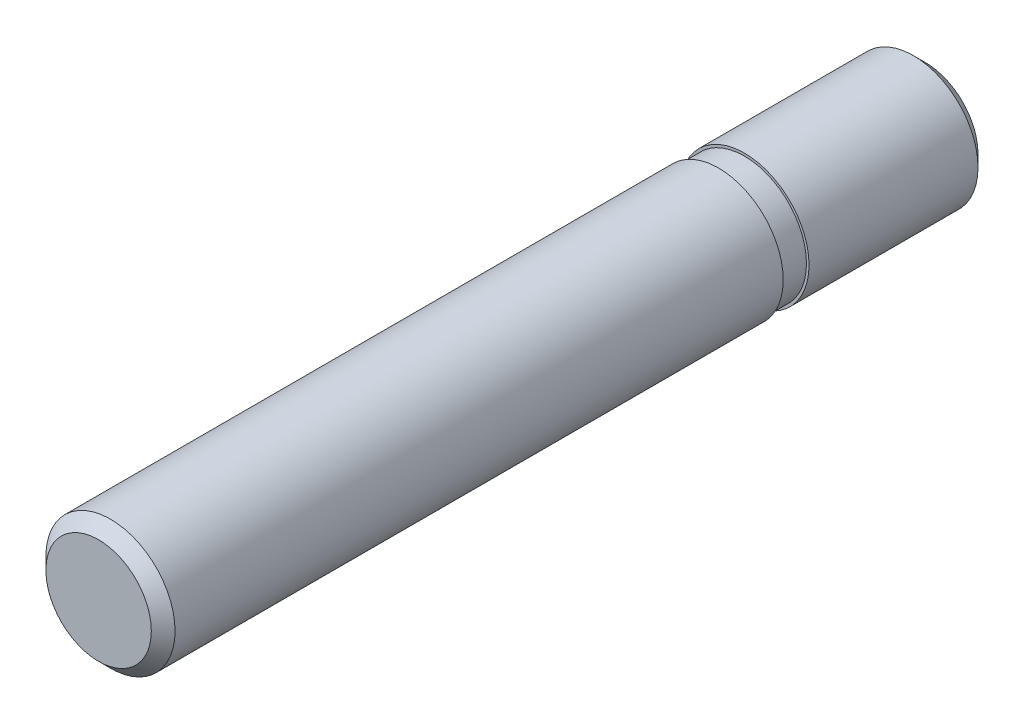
ISO-10303-21;
HEADER;
FILE_DESCRIPTION(('STEP AP214'),'2;1');
FILE_NAME('part.step','',(''),(''),'','','');
FILE_SCHEMA(('AUTOMOTIVE_DESIGN { 1 0 10303 214 1 1 1 1 }'));
ENDSEC;
DATA;
#1=APPLICATION_CONTEXT('core data for automotive mechanical design processes');
#2=APPLICATION_PROTOCOL_DEFINITION('international standard','automotive_design',2000,#1);
#3=PRODUCT_CONTEXT('',#1,'mechanical');
#4=PRODUCT('Part','Part','',(#3));
#5=PRODUCT_RELATED_PRODUCT_CATEGORY('part','',(#4));
#6=PRODUCT_DEFINITION_FORMATION('','',#4);
#7=PRODUCT_DEFINITION_CONTEXT('part definition',#1,'design');
#8=PRODUCT_DEFINITION('design','',#6,#7);
#9=PRODUCT_DEFINITION_SHAPE('','',#8);
#10=(LENGTH_UNIT() NAMED_UNIT(*) SI_UNIT(.MILLI.,.METRE.));
#11=(NAMED_UNIT(*) PLANE_ANGLE_UNIT() SI_UNIT($,.RADIAN.));
#12=(NAMED_UNIT(*) SI_UNIT($,.STERADIAN.) SOLID_ANGLE_UNIT());
#13=UNCERTAINTY_MEASURE_WITH_UNIT(LENGTH_MEASURE(1.E-05),#10,'distance_accuracy_value','');
#14=(GEOMETRIC_REPRESENTATION_CONTEXT(3) GLOBAL_UNCERTAINTY_ASSIGNED_CONTEXT((#13)) GLOBAL_UNIT_ASSIGNED_CONTEXT((#10,
#11,#12)) REPRESENTATION_CONTEXT('',''));
#15=CARTESIAN_POINT('',(0.,0.,0.));
#16=DIRECTION('',(0.,0.,1.));
#17=DIRECTION('',(1.,0.,0.));
#18=AXIS2_PLACEMENT_3D('',#15,#16,#17);
#19=CARTESIAN_POINT('',(0.,2.04,-14.));
#20=DIRECTION('',(0.,0.,-1.));
#21=DIRECTION('',(-1.,0.,0.));
#22=AXIS2_PLACEMENT_3D('',#19,#20,#21);
#23=PLANE('',#22);
#24=CARTESIAN_POINT('',(0.,0.,-14.));
#25=DIRECTION('',(0.,0.,1.));
#26=DIRECTION('',(1.,0.,0.));
#27=AXIS2_PLACEMENT_3D('',#24,#25,#26);
#28=CIRCLE('',#27,4.08000000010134);
#29=CARTESIAN_POINT('',(4.08000000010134,0.,-14.));
#30=VERTEX_POINT('',#29);
#31=EDGE_CURVE('E19',#30,#30,#28,.T.);
#32=ORIENTED_EDGE('',*,*,#31,.F.);
#33=EDGE_LOOP('',(#32));
#34=FACE_BOUND('',#33,.T.);
#35=ADVANCED_FACE('F12',(#34),#23,.T.);
#36=CARTESIAN_POINT('',(0.,0.,-13.080000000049));
#37=DIRECTION('',(0.,0.,1.));
#38=DIRECTION('',(1.,0.,0.));
#39=AXIS2_PLACEMENT_3D('',#36,#37,#38);
#40=CONICAL_SURFACE('',#39,5.0000000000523,0.785398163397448);
#41=CARTESIAN_POINT('',(0.,0.,-13.08));
#42=DIRECTION('',(0.,0.,1.));
#43=DIRECTION('',(1.,0.,0.));
#44=AXIS2_PLACEMENT_3D('',#41,#42,#43);
#45=CIRCLE('',#44,5.);
#46=CARTESIAN_POINT('',(5.,0.,-13.08));
#47=VERTEX_POINT('',#46);
#48=EDGE_CURVE('E23',#47,#47,#45,.T.);
#49=ORIENTED_EDGE('',*,*,#48,.F.);
#50=EDGE_LOOP('',(#49));
#51=FACE_BOUND('',#50,.T.);
#52=ORIENTED_EDGE('',*,*,#31,.T.);
#53=EDGE_LOOP('',(#52));
#54=FACE_BOUND('',#53,.T.);
#55=ADVANCED_FACE('F66',(#51,#54),#40,.T.);
#56=CARTESIAN_POINT('',(0.,0.,4.));
#57=DIRECTION('',(0.,0.,1.));
#58=DIRECTION('',(1.,0.,0.));
#59=AXIS2_PLACEMENT_3D('',#56,#57,#58);
#60=CYLINDRICAL_SURFACE('',#59,5.);
#61=CARTESIAN_POINT('',(0.,0.,0.));
#62=DIRECTION('',(0.,0.,1.));
#63=DIRECTION('',(1.,0.,0.));
#64=AXIS2_PLACEMENT_3D('',#61,#62,#63);
#65=CIRCLE('',#64,5.);
#66=CARTESIAN_POINT('',(5.,0.,0.));
#67=VERTEX_POINT('',#66);
#68=EDGE_CURVE('E28',#67,#67,#65,.T.);
#69=ORIENTED_EDGE('',*,*,#68,.F.);
#70=EDGE_LOOP('',(#69));
#71=FACE_BOUND('',#70,.T.);
#72=ORIENTED_EDGE('',*,*,#48,.T.);
#73=EDGE_LOOP('',(#72));
#74=FACE_BOUND('',#73,.T.);
#75=ADVANCED_FACE('F72',(#71,#74),#60,.T.);
#76=CARTESIAN_POINT('',(0.,0.,0.));
#77=DIRECTION('',(0.,0.,1.));
#78=DIRECTION('',(1.,0.,0.));
#79=AXIS2_PLACEMENT_3D('',#76,#77,#78);
#80=PLANE('',#79);
#81=CARTESIAN_POINT('',(0.,0.,0.));
#82=DIRECTION('',(0.,0.,1.));
#83=DIRECTION('',(1.,0.,0.));
#84=AXIS2_PLACEMENT_3D('',#81,#82,#83);
#85=CIRCLE('',#84,4.8);
#86=CARTESIAN_POINT('',(4.8,0.,0.));
#87=VERTEX_POINT('',#86);
#88=EDGE_CURVE('E8',#87,#87,#85,.T.);
#89=ORIENTED_EDGE('',*,*,#88,.F.);
#90=EDGE_LOOP('',(#89));
#91=FACE_BOUND('',#90,.T.);
#92=ORIENTED_EDGE('',*,*,#68,.T.);
#93=EDGE_LOOP('',(#92));
#94=FACE_BOUND('',#93,.T.);
#95=ADVANCED_FACE('F77',(#91,#94),#80,.T.);
#96=CARTESIAN_POINT('',(0.,0.,-2.76013748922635));
#97=DIRECTION('',(0.,0.,-1.));
#98=DIRECTION('',(-1.,0.,0.));
#99=AXIS2_PLACEMENT_3D('',#96,#97,#98);
#100=CYLINDRICAL_SURFACE('',#99,4.8);
#101=CARTESIAN_POINT('',(0.,0.,2.));
#102=DIRECTION('',(0.,0.,-1.));
#103=DIRECTION('',(-1.,0.,0.));
#104=AXIS2_PLACEMENT_3D('',#101,#102,#103);
#105=CIRCLE('',#104,4.8);
#106=CARTESIAN_POINT('',(-4.8,0.,2.));
#107=VERTEX_POINT('',#106);
#108=EDGE_CURVE('E44',#107,#107,#105,.T.);
#109=ORIENTED_EDGE('',*,*,#108,.T.);
#110=EDGE_LOOP('',(#109));
#111=FACE_BOUND('',#110,.T.);
#112=ORIENTED_EDGE('',*,*,#88,.T.);
#113=EDGE_LOOP('',(#112));
#114=FACE_BOUND('',#113,.T.);
#115=ADVANCED_FACE('F51',(#111,#114),#100,.T.);
#116=CARTESIAN_POINT('',(0.,0.,50.));
#117=DIRECTION('',(0.,0.,1.));
#118=DIRECTION('',(1.,0.,0.));
#119=AXIS2_PLACEMENT_3D('',#116,#117,#118);
#120=PLANE('',#119);
#121=CARTESIAN_POINT('',(0.,0.,50.));
#122=DIRECTION('',(0.,0.,1.));
#123=DIRECTION('',(1.,0.,0.));
#124=AXIS2_PLACEMENT_3D('',#121,#122,#123);
#125=CIRCLE('',#124,4.08);
#126=CARTESIAN_POINT('',(4.08,0.,50.));
#127=VERTEX_POINT('',#126);
#128=EDGE_CURVE('E40',#127,#127,#125,.T.);
#129=ORIENTED_EDGE('',*,*,#128,.T.);
#130=EDGE_LOOP('',(#129));
#131=FACE_BOUND('',#130,.T.);
#132=ADVANCED_FACE('F85',(#131),#120,.T.);
#133=CARTESIAN_POINT('',(0.,0.,50.));
#134=DIRECTION('',(0.,0.,-1.));
#135=DIRECTION('',(-1.,0.,0.));
#136=AXIS2_PLACEMENT_3D('',#133,#134,#135);
#137=CONICAL_SURFACE('',#136,4.08,0.78539816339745);
#138=CARTESIAN_POINT('',(0.,0.,49.08));
#139=DIRECTION('',(0.,0.,1.));
#140=DIRECTION('',(1.,0.,0.));
#141=AXIS2_PLACEMENT_3D('',#138,#139,#140);
#142=CIRCLE('',#141,5.);
#143=CARTESIAN_POINT('',(5.,0.,49.08));
#144=VERTEX_POINT('',#143);
#145=EDGE_CURVE('E31',#144,#144,#142,.F.);
#146=ORIENTED_EDGE('',*,*,#145,.F.);
#147=EDGE_LOOP('',(#146));
#148=FACE_BOUND('',#147,.T.);
#149=ORIENTED_EDGE('',*,*,#128,.F.);
#150=EDGE_LOOP('',(#149));
#151=FACE_BOUND('',#150,.T.);
#152=ADVANCED_FACE('F62',(#148,#151),#137,.T.);
#153=CARTESIAN_POINT('',(0.,0.,4.));
#154=DIRECTION('',(0.,0.,1.));
#155=DIRECTION('',(1.,0.,0.));
#156=AXIS2_PLACEMENT_3D('',#153,#154,#155);
#157=CYLINDRICAL_SURFACE('',#156,5.);
#158=CARTESIAN_POINT('',(0.,0.,2.));
#159=DIRECTION('',(0.,0.,1.));
#160=DIRECTION('',(1.,0.,0.));
#161=AXIS2_PLACEMENT_3D('',#158,#159,#160);
#162=CIRCLE('',#161,5.);
#163=CARTESIAN_POINT('',(5.,0.,2.));
#164=VERTEX_POINT('',#163);
#165=EDGE_CURVE('E35',#164,#164,#162,.T.);
#166=ORIENTED_EDGE('',*,*,#165,.T.);
#167=EDGE_LOOP('',(#166));
#168=FACE_BOUND('',#167,.T.);
#169=ORIENTED_EDGE('',*,*,#145,.T.);
#170=EDGE_LOOP('',(#169));
#171=FACE_BOUND('',#170,.T.);
#172=ADVANCED_FACE('F14',(#168,#171),#157,.T.);
#173=CARTESIAN_POINT('',(0.,0.,2.));
#174=DIRECTION('',(0.,0.,1.));
#175=DIRECTION('',(1.,0.,0.));
#176=AXIS2_PLACEMENT_3D('',#173,#174,#175);
#177=PLANE('',#176);
#178=ORIENTED_EDGE('',*,*,#108,.F.);
#179=EDGE_LOOP('',(#178));
#180=FACE_BOUND('',#179,.T.);
#181=ORIENTED_EDGE('',*,*,#165,.F.);
#182=EDGE_LOOP('',(#181));
#183=FACE_BOUND('',#182,.T.);
#184=ADVANCED_FACE('F53',(#180,#183),#177,.F.);
#185=CLOSED_SHELL('',(#35,#55,#75,#95,#115,#132,#152,#172,#184));
#186=MANIFOLD_SOLID_BREP('B1',#185);
#187=ADVANCED_BREP_SHAPE_REPRESENTATION('',(#18,#186),#14);
#188=SHAPE_DEFINITION_REPRESENTATION(#9,#187);
ENDSEC;
END-ISO-10303-21;
